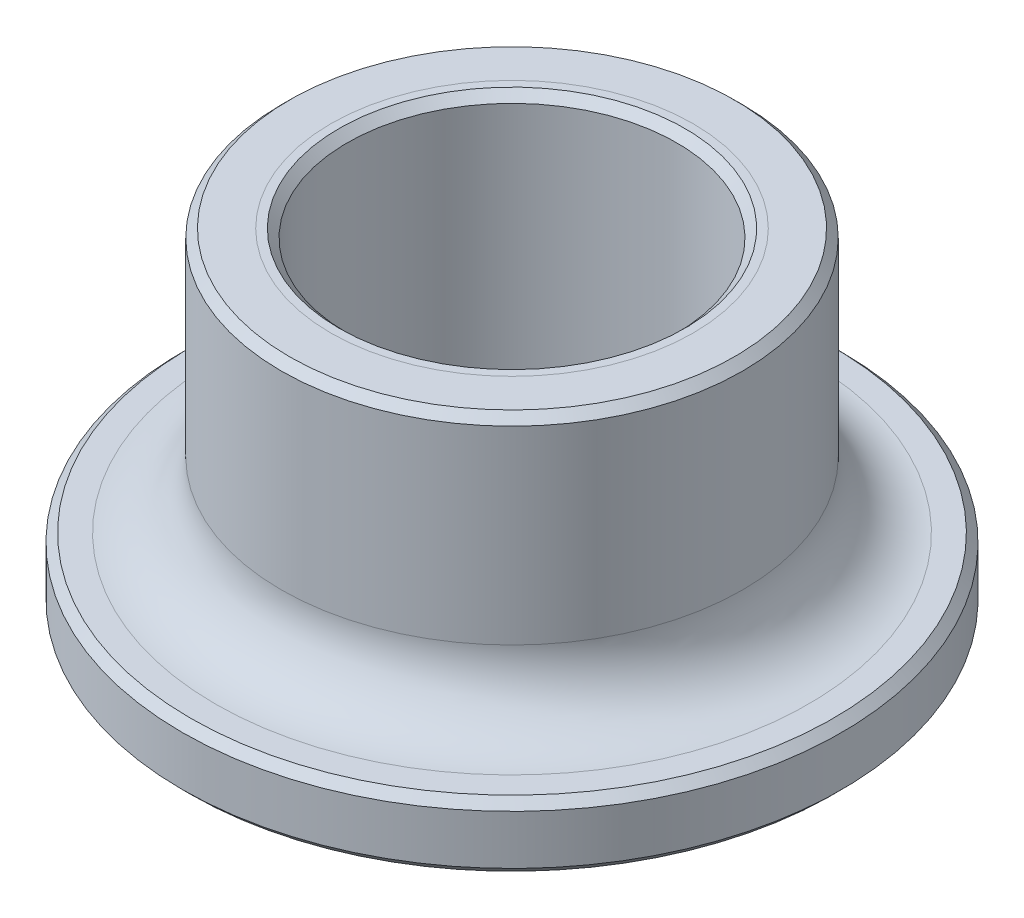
ISO-10303-21;
HEADER;
FILE_DESCRIPTION(('STEP AP214'),'2;1');
FILE_NAME('part.step','',(''),(''),'','','');
FILE_SCHEMA(('AUTOMOTIVE_DESIGN { 1 0 10303 214 1 1 1 1 }'));
ENDSEC;
DATA;
#1=APPLICATION_CONTEXT('core data for automotive mechanical design processes');
#2=APPLICATION_PROTOCOL_DEFINITION('international standard','automotive_design',2000,#1);
#3=PRODUCT_CONTEXT('',#1,'mechanical');
#4=PRODUCT('Part','Part','',(#3));
#5=PRODUCT_RELATED_PRODUCT_CATEGORY('part','',(#4));
#6=PRODUCT_DEFINITION_FORMATION('','',#4);
#7=PRODUCT_DEFINITION_CONTEXT('part definition',#1,'design');
#8=PRODUCT_DEFINITION('design','',#6,#7);
#9=PRODUCT_DEFINITION_SHAPE('','',#8);
#10=(LENGTH_UNIT() NAMED_UNIT(*) SI_UNIT(.MILLI.,.METRE.));
#11=(NAMED_UNIT(*) PLANE_ANGLE_UNIT() SI_UNIT($,.RADIAN.));
#12=(NAMED_UNIT(*) SI_UNIT($,.STERADIAN.) SOLID_ANGLE_UNIT());
#13=UNCERTAINTY_MEASURE_WITH_UNIT(LENGTH_MEASURE(1.E-05),#10,'distance_accuracy_value','');
#14=(GEOMETRIC_REPRESENTATION_CONTEXT(3) GLOBAL_UNCERTAINTY_ASSIGNED_CONTEXT((#13)) GLOBAL_UNIT_ASSIGNED_CONTEXT((#10,
#11,#12)) REPRESENTATION_CONTEXT('',''));
#15=CARTESIAN_POINT('',(0.,0.,0.));
#16=DIRECTION('',(0.,0.,1.));
#17=DIRECTION('',(1.,0.,0.));
#18=AXIS2_PLACEMENT_3D('',#15,#16,#17);
#19=CARTESIAN_POINT('',(0.,10.,0.));
#20=DIRECTION('',(0.,1.,0.));
#21=DIRECTION('',(0.,0.,1.));
#22=AXIS2_PLACEMENT_3D('',#19,#20,#21);
#23=PLANE('',#22);
#24=CARTESIAN_POINT('',(0.,10.,0.));
#25=DIRECTION('',(0.,1.,0.));
#26=DIRECTION('',(0.,0.,1.));
#27=AXIS2_PLACEMENT_3D('',#24,#25,#26);
#28=CIRCLE('',#27,6.75);
#29=CARTESIAN_POINT('',(0.,10.,6.75));
#30=VERTEX_POINT('',#29);
#31=EDGE_CURVE('E50',#30,#30,#28,.T.);
#32=ORIENTED_EDGE('',*,*,#31,.T.);
#33=EDGE_LOOP('',(#32));
#34=FACE_BOUND('',#33,.T.);
#35=CARTESIAN_POINT('',(0.,10.,0.));
#36=DIRECTION('',(0.,1.,0.));
#37=DIRECTION('',(0.,0.,1.));
#38=AXIS2_PLACEMENT_3D('',#35,#36,#37);
#39=CIRCLE('',#38,5.5);
#40=CARTESIAN_POINT('',(0.,10.,5.5));
#41=VERTEX_POINT('',#40);
#42=EDGE_CURVE('E79',#41,#41,#39,.F.);
#43=ORIENTED_EDGE('',*,*,#42,.T.);
#44=EDGE_LOOP('',(#43));
#45=FACE_BOUND('',#44,.T.);
#46=ADVANCED_FACE('F35',(#34,#45),#23,.T.);
#47=CARTESIAN_POINT('',(0.,2.,0.));
#48=DIRECTION('',(0.,1.,0.));
#49=DIRECTION('',(0.,0.,1.));
#50=AXIS2_PLACEMENT_3D('',#47,#48,#49);
#51=PLANE('',#50);
#52=CARTESIAN_POINT('',(0.,2.,0.));
#53=DIRECTION('',(0.,1.,0.));
#54=DIRECTION('',(0.,0.,1.));
#55=AXIS2_PLACEMENT_3D('',#52,#53,#54);
#56=CIRCLE('',#55,9.);
#57=CARTESIAN_POINT('',(0.,2.,9.));
#58=VERTEX_POINT('',#57);
#59=EDGE_CURVE('E10',#58,#58,#56,.F.);
#60=ORIENTED_EDGE('',*,*,#59,.T.);
#61=EDGE_LOOP('',(#60));
#62=FACE_BOUND('',#61,.T.);
#63=CARTESIAN_POINT('',(0.,2.,0.));
#64=DIRECTION('',(0.,1.,0.));
#65=DIRECTION('',(0.,0.,1.));
#66=AXIS2_PLACEMENT_3D('',#63,#64,#65);
#67=CIRCLE('',#66,9.75);
#68=CARTESIAN_POINT('',(0.,2.,9.75));
#69=VERTEX_POINT('',#68);
#70=EDGE_CURVE('E76',#69,#69,#67,.T.);
#71=ORIENTED_EDGE('',*,*,#70,.T.);
#72=EDGE_LOOP('',(#71));
#73=FACE_BOUND('',#72,.T.);
#74=ADVANCED_FACE('F103',(#62,#73),#51,.T.);
#75=CARTESIAN_POINT('',(0.,2.,0.));
#76=DIRECTION('',(0.,-1.,0.));
#77=DIRECTION('',(0.,0.,-1.));
#78=AXIS2_PLACEMENT_3D('',#75,#76,#77);
#79=CYLINDRICAL_SURFACE('',#78,10.);
#80=CARTESIAN_POINT('',(0.,1.74999999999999,0.));
#81=DIRECTION('',(0.,1.,0.));
#82=DIRECTION('',(0.,0.,1.));
#83=AXIS2_PLACEMENT_3D('',#80,#81,#82);
#84=CIRCLE('',#83,10.);
#85=CARTESIAN_POINT('',(0.,1.74999999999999,10.));
#86=VERTEX_POINT('',#85);
#87=EDGE_CURVE('E70',#86,#86,#84,.F.);
#88=ORIENTED_EDGE('',*,*,#87,.T.);
#89=EDGE_LOOP('',(#88));
#90=FACE_BOUND('',#89,.T.);
#91=CARTESIAN_POINT('',(0.,0.249999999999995,0.));
#92=DIRECTION('',(0.,1.,0.));
#93=DIRECTION('',(0.,0.,1.));
#94=AXIS2_PLACEMENT_3D('',#91,#92,#93);
#95=CIRCLE('',#94,10.);
#96=CARTESIAN_POINT('',(0.,0.249999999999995,10.));
#97=VERTEX_POINT('',#96);
#98=EDGE_CURVE('E73',#97,#97,#95,.T.);
#99=ORIENTED_EDGE('',*,*,#98,.T.);
#100=EDGE_LOOP('',(#99));
#101=FACE_BOUND('',#100,.T.);
#102=ADVANCED_FACE('F108',(#90,#101),#79,.T.);
#103=CARTESIAN_POINT('',(0.,0.,0.));
#104=DIRECTION('',(0.,1.,0.));
#105=DIRECTION('',(0.,0.,1.));
#106=AXIS2_PLACEMENT_3D('',#103,#104,#105);
#107=PLANE('',#106);
#108=CARTESIAN_POINT('',(0.,0.,0.));
#109=DIRECTION('',(0.,1.,0.));
#110=DIRECTION('',(0.,0.,1.));
#111=AXIS2_PLACEMENT_3D('',#108,#109,#110);
#112=CIRCLE('',#111,5.25);
#113=CARTESIAN_POINT('',(0.,0.,5.25));
#114=VERTEX_POINT('',#113);
#115=EDGE_CURVE('E64',#114,#114,#112,.T.);
#116=ORIENTED_EDGE('',*,*,#115,.T.);
#117=EDGE_LOOP('',(#116));
#118=FACE_BOUND('',#117,.T.);
#119=CARTESIAN_POINT('',(0.,0.,0.));
#120=DIRECTION('',(0.,1.,0.));
#121=DIRECTION('',(0.,0.,1.));
#122=AXIS2_PLACEMENT_3D('',#119,#120,#121);
#123=CIRCLE('',#122,9.75);
#124=CARTESIAN_POINT('',(0.,0.,9.75));
#125=VERTEX_POINT('',#124);
#126=EDGE_CURVE('E67',#125,#125,#123,.F.);
#127=ORIENTED_EDGE('',*,*,#126,.T.);
#128=EDGE_LOOP('',(#127));
#129=FACE_BOUND('',#128,.T.);
#130=ADVANCED_FACE('F100',(#118,#129),#107,.F.);
#131=CARTESIAN_POINT('',(0.,10.,0.));
#132=DIRECTION('',(0.,-1.,0.));
#133=DIRECTION('',(0.,0.,-1.));
#134=AXIS2_PLACEMENT_3D('',#131,#132,#133);
#135=CYLINDRICAL_SURFACE('',#134,7.);
#136=CARTESIAN_POINT('',(0.,4.,0.));
#137=DIRECTION('',(0.,1.,0.));
#138=DIRECTION('',(0.,0.,1.));
#139=AXIS2_PLACEMENT_3D('',#136,#137,#138);
#140=CIRCLE('',#139,7.);
#141=CARTESIAN_POINT('',(0.,4.,7.));
#142=VERTEX_POINT('',#141);
#143=EDGE_CURVE('E42',#142,#142,#140,.T.);
#144=ORIENTED_EDGE('',*,*,#143,.T.);
#145=EDGE_LOOP('',(#144));
#146=FACE_BOUND('',#145,.T.);
#147=CARTESIAN_POINT('',(0.,9.75,0.));
#148=DIRECTION('',(0.,1.,0.));
#149=DIRECTION('',(0.,0.,1.));
#150=AXIS2_PLACEMENT_3D('',#147,#148,#149);
#151=CIRCLE('',#150,7.);
#152=CARTESIAN_POINT('',(0.,9.75,7.));
#153=VERTEX_POINT('',#152);
#154=EDGE_CURVE('E46',#153,#153,#151,.F.);
#155=ORIENTED_EDGE('',*,*,#154,.T.);
#156=EDGE_LOOP('',(#155));
#157=FACE_BOUND('',#156,.T.);
#158=ADVANCED_FACE('F90',(#146,#157),#135,.T.);
#159=CARTESIAN_POINT('',(0.,10.,0.));
#160=DIRECTION('',(0.,1.,0.));
#161=DIRECTION('',(0.,0.,1.));
#162=AXIS2_PLACEMENT_3D('',#159,#160,#161);
#163=CIRCLE('',#162,5.25);
#164=CARTESIAN_POINT('',(0.,10.,5.25));
#165=VERTEX_POINT('',#164);
#166=EDGE_CURVE('E55',#165,#165,#163,.F.);
#167=ORIENTED_EDGE('',*,*,#166,.T.);
#168=EDGE_LOOP('',(#167));
#169=FACE_BOUND('',#168,.T.);
#170=ORIENTED_EDGE('',*,*,#42,.F.);
#171=EDGE_LOOP('',(#170));
#172=FACE_BOUND('',#171,.T.);
#173=ADVANCED_FACE('F87',(#169,#172),#23,.T.);
#174=CARTESIAN_POINT('',(0.,0.,0.));
#175=DIRECTION('',(0.,1.,0.));
#176=DIRECTION('',(0.,0.,1.));
#177=AXIS2_PLACEMENT_3D('',#174,#175,#176);
#178=CYLINDRICAL_SURFACE('',#177,5.);
#179=CARTESIAN_POINT('',(0.,0.250000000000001,0.));
#180=DIRECTION('',(0.,1.,0.));
#181=DIRECTION('',(0.,0.,1.));
#182=AXIS2_PLACEMENT_3D('',#179,#180,#181);
#183=CIRCLE('',#182,5.);
#184=CARTESIAN_POINT('',(0.,0.250000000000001,5.));
#185=VERTEX_POINT('',#184);
#186=EDGE_CURVE('E58',#185,#185,#183,.F.);
#187=ORIENTED_EDGE('',*,*,#186,.T.);
#188=EDGE_LOOP('',(#187));
#189=FACE_BOUND('',#188,.T.);
#190=CARTESIAN_POINT('',(0.,9.75,0.));
#191=DIRECTION('',(0.,1.,0.));
#192=DIRECTION('',(0.,0.,1.));
#193=AXIS2_PLACEMENT_3D('',#190,#191,#192);
#194=CIRCLE('',#193,5.);
#195=CARTESIAN_POINT('',(0.,9.75,5.));
#196=VERTEX_POINT('',#195);
#197=EDGE_CURVE('E61',#196,#196,#194,.T.);
#198=ORIENTED_EDGE('',*,*,#197,.T.);
#199=EDGE_LOOP('',(#198));
#200=FACE_BOUND('',#199,.T.);
#201=ADVANCED_FACE('F89',(#189,#200),#178,.F.);
#202=CARTESIAN_POINT('',(0.,2.,0.));
#203=DIRECTION('',(0.,-1.,0.));
#204=DIRECTION('',(0.,0.,-1.));
#205=AXIS2_PLACEMENT_3D('',#202,#203,#204);
#206=CONICAL_SURFACE('',#205,9.75,0.785398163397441);
#207=ORIENTED_EDGE('',*,*,#87,.F.);
#208=EDGE_LOOP('',(#207));
#209=FACE_BOUND('',#208,.T.);
#210=ORIENTED_EDGE('',*,*,#70,.F.);
#211=EDGE_LOOP('',(#210));
#212=FACE_BOUND('',#211,.T.);
#213=ADVANCED_FACE('F97',(#209,#212),#206,.T.);
#214=CARTESIAN_POINT('',(0.,0.,0.));
#215=DIRECTION('',(0.,-1.,0.));
#216=DIRECTION('',(0.,0.,-1.));
#217=AXIS2_PLACEMENT_3D('',#214,#215,#216);
#218=CONICAL_SURFACE('',#217,5.25,0.785398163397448);
#219=ORIENTED_EDGE('',*,*,#186,.F.);
#220=EDGE_LOOP('',(#219));
#221=FACE_BOUND('',#220,.T.);
#222=ORIENTED_EDGE('',*,*,#115,.F.);
#223=EDGE_LOOP('',(#222));
#224=FACE_BOUND('',#223,.T.);
#225=ADVANCED_FACE('F128',(#221,#224),#218,.F.);
#226=CARTESIAN_POINT('',(0.,9.75,0.));
#227=DIRECTION('',(0.,1.,0.));
#228=DIRECTION('',(0.,0.,1.));
#229=AXIS2_PLACEMENT_3D('',#226,#227,#228);
#230=CONICAL_SURFACE('',#229,5.,0.78539816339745);
#231=ORIENTED_EDGE('',*,*,#166,.F.);
#232=EDGE_LOOP('',(#231));
#233=FACE_BOUND('',#232,.T.);
#234=ORIENTED_EDGE('',*,*,#197,.F.);
#235=EDGE_LOOP('',(#234));
#236=FACE_BOUND('',#235,.T.);
#237=ADVANCED_FACE('F121',(#233,#236),#230,.F.);
#238=CARTESIAN_POINT('',(0.,0.249999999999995,0.));
#239=DIRECTION('',(0.,1.,0.));
#240=DIRECTION('',(0.,0.,1.));
#241=AXIS2_PLACEMENT_3D('',#238,#239,#240);
#242=CONICAL_SURFACE('',#241,10.,0.785398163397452);
#243=ORIENTED_EDGE('',*,*,#126,.F.);
#244=EDGE_LOOP('',(#243));
#245=FACE_BOUND('',#244,.T.);
#246=ORIENTED_EDGE('',*,*,#98,.F.);
#247=EDGE_LOOP('',(#246));
#248=FACE_BOUND('',#247,.T.);
#249=ADVANCED_FACE('F114',(#245,#248),#242,.T.);
#250=CARTESIAN_POINT('',(0.,10.,0.));
#251=DIRECTION('',(0.,-1.,0.));
#252=DIRECTION('',(0.,0.,-1.));
#253=AXIS2_PLACEMENT_3D('',#250,#251,#252);
#254=CONICAL_SURFACE('',#253,6.75,0.785398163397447);
#255=ORIENTED_EDGE('',*,*,#154,.F.);
#256=EDGE_LOOP('',(#255));
#257=FACE_BOUND('',#256,.T.);
#258=ORIENTED_EDGE('',*,*,#31,.F.);
#259=EDGE_LOOP('',(#258));
#260=FACE_BOUND('',#259,.T.);
#261=ADVANCED_FACE('F112',(#257,#260),#254,.T.);
#262=CARTESIAN_POINT('',(0.,4.,0.));
#263=DIRECTION('',(0.,1.,0.));
#264=DIRECTION('',(0.,0.,1.));
#265=AXIS2_PLACEMENT_3D('',#262,#263,#264);
#266=TOROIDAL_SURFACE('',#265,9.,2.);
#267=ORIENTED_EDGE('',*,*,#59,.F.);
#268=EDGE_LOOP('',(#267));
#269=FACE_BOUND('',#268,.T.);
#270=ORIENTED_EDGE('',*,*,#143,.F.);
#271=EDGE_LOOP('',(#270));
#272=FACE_BOUND('',#271,.T.);
#273=ADVANCED_FACE('F37',(#269,#272),#266,.F.);
#274=CLOSED_SHELL('',(#46,#74,#102,#130,#158,#173,#201,#213,#225,#237,#249,#261,#273));
#275=MANIFOLD_SOLID_BREP('B2',#274);
#276=ADVANCED_BREP_SHAPE_REPRESENTATION('',(#18,#275),#14);
#277=SHAPE_DEFINITION_REPRESENTATION(#9,#276);
ENDSEC;
END-ISO-10303-21;
